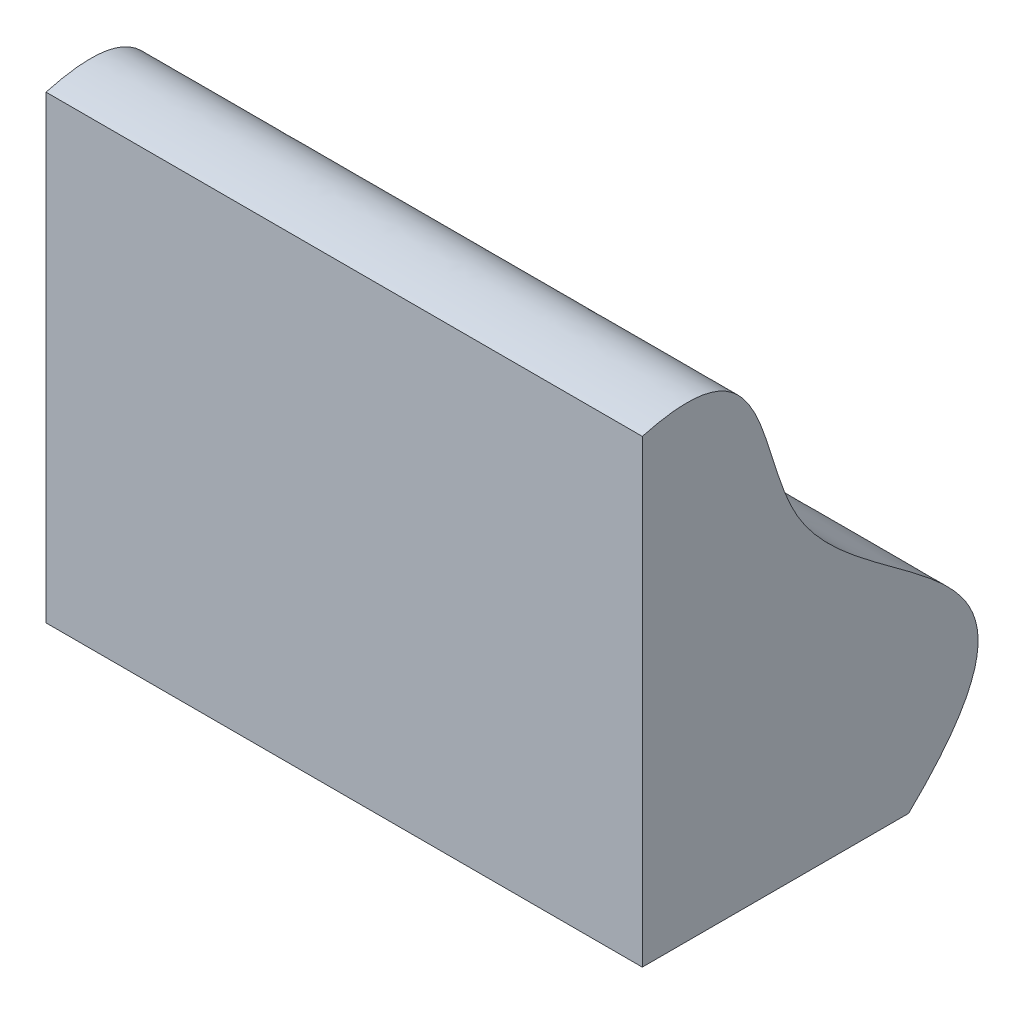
ISO-10303-21;
HEADER;
FILE_DESCRIPTION(('STEP AP214'),'2;1');
FILE_NAME('part.step','',(''),(''),'','','');
FILE_SCHEMA(('AUTOMOTIVE_DESIGN { 1 0 10303 214 1 1 1 1 }'));
ENDSEC;
DATA;
#1=APPLICATION_CONTEXT('core data for automotive mechanical design processes');
#2=APPLICATION_PROTOCOL_DEFINITION('international standard','automotive_design',2000,#1);
#3=PRODUCT_CONTEXT('',#1,'mechanical');
#4=PRODUCT('Part','Part','',(#3));
#5=PRODUCT_RELATED_PRODUCT_CATEGORY('part','',(#4));
#6=PRODUCT_DEFINITION_FORMATION('','',#4);
#7=PRODUCT_DEFINITION_CONTEXT('part definition',#1,'design');
#8=PRODUCT_DEFINITION('design','',#6,#7);
#9=PRODUCT_DEFINITION_SHAPE('','',#8);
#10=(LENGTH_UNIT() NAMED_UNIT(*) SI_UNIT(.MILLI.,.METRE.));
#11=(NAMED_UNIT(*) PLANE_ANGLE_UNIT() SI_UNIT($,.RADIAN.));
#12=(NAMED_UNIT(*) SI_UNIT($,.STERADIAN.) SOLID_ANGLE_UNIT());
#13=UNCERTAINTY_MEASURE_WITH_UNIT(LENGTH_MEASURE(1.E-05),#10,'distance_accuracy_value','');
#14=(GEOMETRIC_REPRESENTATION_CONTEXT(3) GLOBAL_UNCERTAINTY_ASSIGNED_CONTEXT((#13)) GLOBAL_UNIT_ASSIGNED_CONTEXT((#10,
#11,#12)) REPRESENTATION_CONTEXT('',''));
#15=CARTESIAN_POINT('',(0.,0.,0.));
#16=DIRECTION('',(0.,0.,1.));
#17=DIRECTION('',(1.,0.,0.));
#18=AXIS2_PLACEMENT_3D('',#15,#16,#17);
#19=CARTESIAN_POINT('',(45.,0.,0.));
#20=DIRECTION('',(0.,1.,0.));
#21=DIRECTION('',(0.,0.,1.));
#22=AXIS2_PLACEMENT_3D('',#19,#20,#21);
#23=PLANE('',#22);
#24=DIRECTION('',(0.,0.,-1.));
#25=VECTOR('',#24,1.);
#26=CARTESIAN_POINT('',(-45.,0.,0.));
#27=LINE('',#26,#25);
#28=CARTESIAN_POINT('',(-45.,0.,0.));
#29=VERTEX_POINT('',#28);
#30=CARTESIAN_POINT('',(-45.,0.,-40.1955865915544));
#31=VERTEX_POINT('',#30);
#32=EDGE_CURVE('E80',#29,#31,#27,.T.);
#33=ORIENTED_EDGE('',*,*,#32,.T.);
#34=DIRECTION('',(-1.,0.,0.));
#35=VECTOR('',#34,1.);
#36=CARTESIAN_POINT('',(45.,0.,-40.1955865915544));
#37=LINE('',#36,#35);
#38=CARTESIAN_POINT('',(45.,0.,-40.1955865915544));
#39=VERTEX_POINT('',#38);
#40=EDGE_CURVE('E11',#39,#31,#37,.T.);
#41=ORIENTED_EDGE('',*,*,#40,.F.);
#42=DIRECTION('',(0.,0.,-1.));
#43=VECTOR('',#42,1.);
#44=CARTESIAN_POINT('',(45.,0.,0.));
#45=LINE('',#44,#43);
#46=CARTESIAN_POINT('',(45.,0.,0.));
#47=VERTEX_POINT('',#46);
#48=EDGE_CURVE('E73',#47,#39,#45,.T.);
#49=ORIENTED_EDGE('',*,*,#48,.F.);
#50=DIRECTION('',(-1.,0.,0.));
#51=VECTOR('',#50,1.);
#52=CARTESIAN_POINT('',(45.,0.,0.));
#53=LINE('',#52,#51);
#54=EDGE_CURVE('E81',#47,#29,#53,.T.);
#55=ORIENTED_EDGE('',*,*,#54,.T.);
#56=EDGE_LOOP('',(#33,#41,#49,#55));
#57=FACE_BOUND('',#56,.T.);
#58=ADVANCED_FACE('F33',(#57),#23,.F.);
#59=CARTESIAN_POINT('',(45.,0.,-40.1955865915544));
#60=CARTESIAN_POINT('',(45.,26.4118392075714,-67.6909164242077));
#61=CARTESIAN_POINT('',(45.,31.2232006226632,-12.9541501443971));
#62=CARTESIAN_POINT('',(45.,74.6922970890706,-19.6192986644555));
#63=CARTESIAN_POINT('',(45.,69.3772952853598,0.));
#64=B_SPLINE_CURVE_WITH_KNOTS('',3,(#59,#60,#61,#62,#63),.UNSPECIFIED.,.F.,.F.,(4,1,4),(0.,
0.623022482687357,1.),.UNSPECIFIED.);
#65=DIRECTION('',(-1.,0.,0.));
#66=VECTOR('',#65,1.);
#67=SURFACE_OF_LINEAR_EXTRUSION('',#64,#66);
#68=CARTESIAN_POINT('',(-45.,0.,-40.1955865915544));
#69=CARTESIAN_POINT('',(-45.,26.4118392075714,-67.6909164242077));
#70=CARTESIAN_POINT('',(-45.,31.2232006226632,-12.9541501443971));
#71=CARTESIAN_POINT('',(-45.,74.6922970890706,-19.6192986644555));
#72=CARTESIAN_POINT('',(-45.,69.3772952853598,0.));
#73=B_SPLINE_CURVE_WITH_KNOTS('',3,(#68,#69,#70,#71,#72),.UNSPECIFIED.,.F.,.F.,(4,1,4),(0.,
0.623022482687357,1.),.UNSPECIFIED.);
#74=CARTESIAN_POINT('',(-45.,69.3772952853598,0.));
#75=VERTEX_POINT('',#74);
#76=EDGE_CURVE('E61',#31,#75,#73,.T.);
#77=ORIENTED_EDGE('',*,*,#76,.T.);
#78=DIRECTION('',(-1.,0.,0.));
#79=VECTOR('',#78,1.);
#80=CARTESIAN_POINT('',(45.,69.3772952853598,0.));
#81=LINE('',#80,#79);
#82=CARTESIAN_POINT('',(45.,69.3772952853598,0.));
#83=VERTEX_POINT('',#82);
#84=EDGE_CURVE('E41',#83,#75,#81,.T.);
#85=ORIENTED_EDGE('',*,*,#84,.F.);
#86=EDGE_CURVE('E69',#39,#83,#64,.T.);
#87=ORIENTED_EDGE('',*,*,#86,.F.);
#88=ORIENTED_EDGE('',*,*,#40,.T.);
#89=EDGE_LOOP('',(#77,#85,#87,#88));
#90=FACE_BOUND('',#89,.T.);
#91=ADVANCED_FACE('F70',(#90),#67,.F.);
#92=CARTESIAN_POINT('',(45.,0.,0.));
#93=DIRECTION('',(0.,0.,-1.));
#94=DIRECTION('',(-1.,0.,0.));
#95=AXIS2_PLACEMENT_3D('',#92,#93,#94);
#96=PLANE('',#95);
#97=DIRECTION('',(0.,-1.,0.));
#98=VECTOR('',#97,1.);
#99=CARTESIAN_POINT('',(-45.,0.,0.));
#100=LINE('',#99,#98);
#101=EDGE_CURVE('E66',#75,#29,#100,.T.);
#102=ORIENTED_EDGE('',*,*,#101,.T.);
#103=ORIENTED_EDGE('',*,*,#54,.F.);
#104=DIRECTION('',(0.,-1.,0.));
#105=VECTOR('',#104,1.);
#106=CARTESIAN_POINT('',(45.,0.,0.));
#107=LINE('',#106,#105);
#108=EDGE_CURVE('E49',#83,#47,#107,.T.);
#109=ORIENTED_EDGE('',*,*,#108,.F.);
#110=ORIENTED_EDGE('',*,*,#84,.T.);
#111=EDGE_LOOP('',(#102,#103,#109,#110));
#112=FACE_BOUND('',#111,.T.);
#113=ADVANCED_FACE('F93',(#112),#96,.F.);
#114=CARTESIAN_POINT('',(45.,38.2071128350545,-31.5331164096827));
#115=DIRECTION('',(-1.,0.,0.));
#116=DIRECTION('',(0.,0.,1.));
#117=AXIS2_PLACEMENT_3D('',#114,#115,#116);
#118=PLANE('',#117);
#119=ORIENTED_EDGE('',*,*,#48,.T.);
#120=ORIENTED_EDGE('',*,*,#86,.T.);
#121=ORIENTED_EDGE('',*,*,#108,.T.);
#122=EDGE_LOOP('',(#119,#120,#121));
#123=FACE_BOUND('',#122,.T.);
#124=ADVANCED_FACE('F76',(#123),#118,.F.);
#125=CARTESIAN_POINT('',(-45.,38.2071128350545,-31.5331164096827));
#126=DIRECTION('',(-1.,0.,0.));
#127=DIRECTION('',(0.,0.,1.));
#128=AXIS2_PLACEMENT_3D('',#125,#126,#127);
#129=PLANE('',#128);
#130=ORIENTED_EDGE('',*,*,#32,.F.);
#131=ORIENTED_EDGE('',*,*,#101,.F.);
#132=ORIENTED_EDGE('',*,*,#76,.F.);
#133=EDGE_LOOP('',(#130,#131,#132));
#134=FACE_BOUND('',#133,.T.);
#135=ADVANCED_FACE('F94',(#134),#129,.T.);
#136=CLOSED_SHELL('',(#58,#91,#113,#124,#135));
#137=MANIFOLD_SOLID_BREP('B2',#136);
#138=ADVANCED_BREP_SHAPE_REPRESENTATION('',(#18,#137),#14);
#139=SHAPE_DEFINITION_REPRESENTATION(#9,#138);
ENDSEC;
END-ISO-10303-21;
